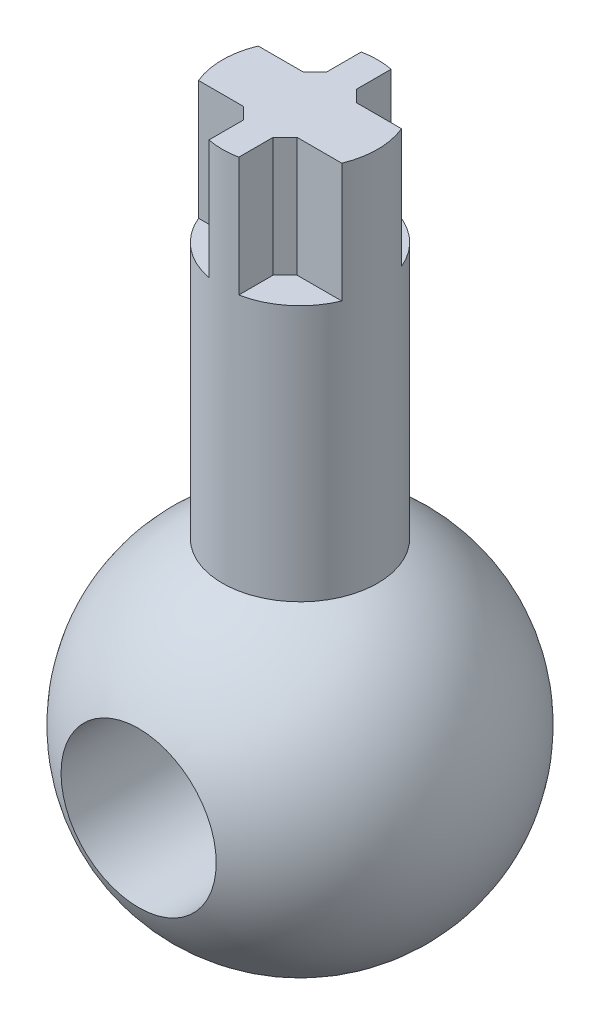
from build123d import *

# Parameters (mm, degrees)
SKETCH_S2_R              = 6.5
EXTRUDE_2_DEPTH          = 45
CUT_EXTRUDE_START        = -10
CUT_EXTRUDE_3_DEPTH      = 10
CHAMFER_4_SIZE           = 1
CUT_EXTRUDE_5_DEPTH      = 50.749371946
CUT_EXTRUDE_5_DEPTH_BACK = 50.749371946
SKETCH_S5_R              = 6.5


with BuildPart() as part:
    # Sketch s1 → Revolve 1 (revolve)
    with BuildSketch(Plane.XY):
        with BuildLine():
            Line((-15, 0), (15, 0))
            ThreePointArc((15, 0), (0, 15), (-15, 0))
        make_face()
    revolve(axis=Axis((-56.6721202, 0, 0), (1, 0, 0)))

    # Sketch s2 → Extrude 2 (add)
    with BuildSketch(Plane(origin=(0, 0, 0), x_dir=(1, 0, 0), z_dir=(0, 1, 0))):
        with Locations(Location((0, 0, 0), (0, 0, 90))):
            Circle(SKETCH_S2_R)
    extrude(amount=EXTRUDE_2_DEPTH)

    # Sketch s3 → Cut-Extrude 3 (cut)
    with BuildSketch(Plane(origin=(0, 45, 0), x_dir=(-1, 0, 0), z_dir=(0, 1, 0)).offset(CUT_EXTRUDE_START)):
        with BuildLine():
            Line((-1.25, -6.378675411), (-1.25, -2.5))
            Line((-1.25, -2.5), (-6, -2.5))
            ThreePointArc((-6, -2.5), (-4.111162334, -5.034713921), (-1.25, -6.378675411))
        make_face()
        with BuildLine():
            Line((1.25, -6.378675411), (1.25, -2.5))
            Line((1.25, -2.5), (6, -2.5))
            ThreePointArc((6, -2.5), (4.111162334, -5.034713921), (1.25, -6.378675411))
        make_face()
        with BuildLine():
            Line((-6, 2.5), (-1.25, 2.5))
            Line((-1.25, 2.5), (-1.25, 6.378675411))
            ThreePointArc((-1.25, 6.378675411), (-4.111162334, 5.034713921), (-6, 2.5))
        make_face()
        with BuildLine():
            Line((1.25, 2.5), (1.25, 6.378675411))
            ThreePointArc((1.25, 6.378675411), (4.111162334, 5.034713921), (6, 2.5))
            Line((6, 2.5), (1.25, 2.5))
        make_face()
    extrude(amount=CUT_EXTRUDE_3_DEPTH, mode=Mode.SUBTRACT)

    # Chamfer 4
    chamfer_4_edges = [part.edges().sort_by_distance(p)[0] for p in [
        (-1.25, 40, -2.5),
        (1.25, 40, 2.5),
        (1.25, 40, -2.5),
        (-1.25, 40, 2.5),
    ]]
    chamfer(chamfer_4_edges, length=CHAMFER_4_SIZE)

    # Sketch s5 → Cut-Extrude 5 (cut, two sides: drawn at the far end of the back side and taken through both)
    with BuildSketch(Plane.XY.offset(-CUT_EXTRUDE_5_DEPTH_BACK)):
        Circle(SKETCH_S5_R)
    extrude(amount=CUT_EXTRUDE_5_DEPTH + CUT_EXTRUDE_5_DEPTH_BACK, mode=Mode.SUBTRACT)


solid = part.part
